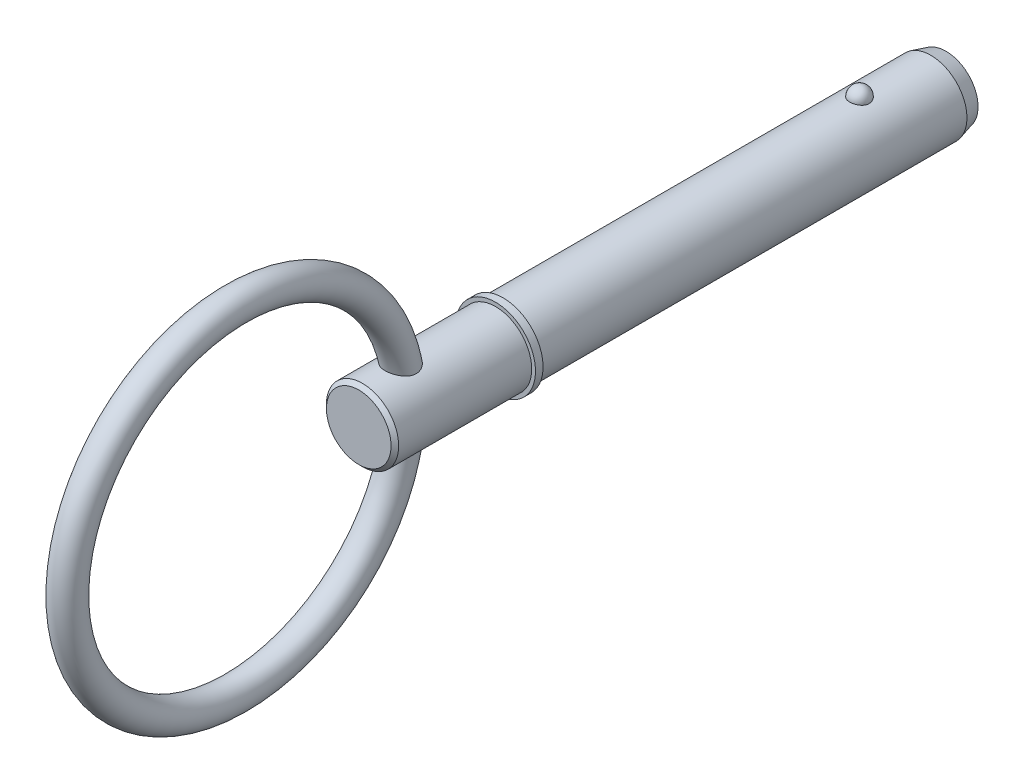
from build123d import *

# Parameters (mm, degrees)
SKETCH2_R           = 4.765
BOSS_EXTRUDE1_DEPTH = 45.72
BOSS_EXTRUDE2_START = 12.7
SKETCH3_R           = 4.765
BOSS_EXTRUDE2_DEPTH = 12.7
CHAMFER1_SIZE       = 2
CHAMFER1_SIZE2      = 0.535898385
SKETCH20_W          = 1
SKETCH20_H          = 5.265
SKETCH21_R          = 4.765
BOSS_EXTRUDE3_DEPTH = 19.05
CHAMFER2_SIZE       = 0.5
SKETCH24_R          = 2


with BuildPart() as part:
    # Sketch2 → Boss-Extrude1 (new body)
    with BuildSketch(Plane.XY):
        Circle(SKETCH2_R)
    extrude(amount=BOSS_EXTRUDE1_DEPTH)

    # Sketch3 → Boss-Extrude2 (add)
    with BuildSketch(Plane(origin=(0, 0, 0), x_dir=(-1, 0, 0), z_dir=(0, 0, -1)).offset(BOSS_EXTRUDE2_START)):
        Circle(SKETCH3_R)
    extrude(amount=-BOSS_EXTRUDE2_DEPTH)

    # Chamfer1
    chamfer1_edges = [part.edges().sort_by_distance(p)[0] for p in [
        (4.765, 0, -12.7),
    ]]
    chamfer1_side = [part.faces().sort_by_distance(p)[0] for p in [
        (4.765, 0, -6.35),
    ]]
    chamfer(chamfer1_edges, length=CHAMFER1_SIZE, length2=CHAMFER1_SIZE2, reference=chamfer1_side[0])

    # Sketch18 → Revolve1 (revolve)
    with BuildSketch(Plane(origin=(0, 0, 0), x_dir=(0, 0, -1), z_dir=(1, 0, 0))):
        with BuildLine():
            Line((1.29, 6.055), (1.29, 3.475))
            ThreePointArc((1.29, 3.475), (0, 4.765), (1.29, 6.055))
        make_face()
    revolve(axis=Axis((0, 6.055, -1.29), (0, -1, 0)))

    # Sketch20 → Revolve2 (revolve)
    with BuildSketch(Plane(origin=(0, 0, 0), x_dir=(0, 0, -1), z_dir=(1, 0, 0)), mode=Mode.PRIVATE) as revolve2_sk:
        with Locations((-46.22, 2.6325)):
            Rectangle(SKETCH20_W, SKETCH20_H)
    revolve(revolve2_sk.sketch.rotate(Axis((0, 0, 33.728787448), (0, 0, 1)), 90), axis=Axis((0, 0, 33.728787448), (0, 0, 1)))

    # Sketch21 → Boss-Extrude3 (add)
    with BuildSketch(Plane(origin=(0, 0, 45.72), x_dir=(-1, 0, 0), z_dir=(0, 0, -1))):
        Circle(SKETCH21_R)
    extrude(amount=-BOSS_EXTRUDE3_DEPTH)

    # Chamfer2
    chamfer2_edges = [part.edges().sort_by_distance(p)[0] for p in [
        (4.765, 0, 64.77),
    ]]
    chamfer(chamfer2_edges, length=CHAMFER2_SIZE)

    # Sweep1: sweep along a path in Sketch23
    with BuildLine(Plane(origin=(0, 0, 0), x_dir=(0, 0, -1), z_dir=(1, 0, 0))) as sweep1_path:
        CenterArc((-80.995, 0), 22.225, 0, 360)
    # Sketch24 → Sweep1 (sweep)
    with BuildSketch(Plane(origin=(0, 0, 0), x_dir=(1, 0, 0), z_dir=(0, 1, 0))):
        with Locations((0, -58.77)):
            Circle(SKETCH24_R)
    sweep(path=sweep1_path.line)


solid = part.part
